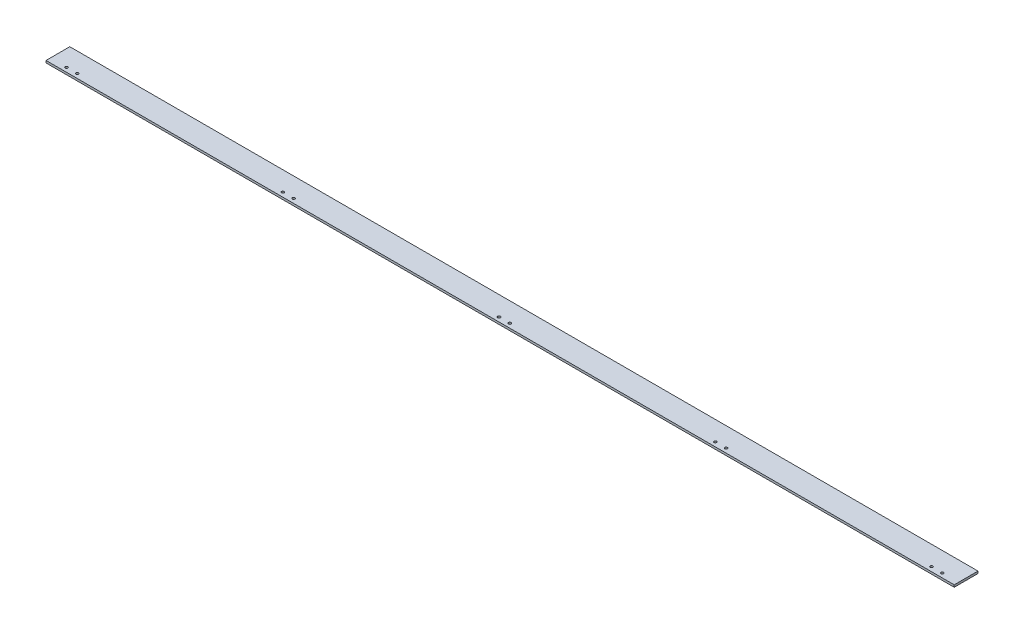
from build123d import *

# Parameters (mm, degrees)
ESQUISSE1_W             = 4200
ESQUISSE1_H             = 110
EXTRUSION1_DEPTH        = 10
ESQUISSE2_R             = 6
ENL_V_MAT_EXTRU_1_DEPTH = 10


with BuildPart() as part:
    # Esquisse1 → Extrusion1 (new body)
    with BuildSketch(Plane(origin=(0, 0, 0), x_dir=(1, 0, 0), z_dir=(0, 1, 0))):
        with Locations((2100, 55)):
            Rectangle(ESQUISSE1_W, ESQUISSE1_H)
    extrude(amount=EXTRUSION1_DEPTH)

    # Esquisse2 → Enl_v. mat.-Extru.1 (cut)
    with BuildSketch(Plane(origin=(0, 10, 0), x_dir=(-1, 0, 0), z_dir=(0, 1, 0))):
        with Locations(Location((-4125, -20, 0), (0, 0, 90))):
            Circle(ESQUISSE2_R)
        with Locations(Location((-4075, -20, 0), (0, 0, 90))):
            Circle(ESQUISSE2_R)
        with Locations(Location((-3125, -20, 0), (0, 0, 90))):
            Circle(ESQUISSE2_R)
        with Locations(Location((-3075, -20, 0), (0, 0, 90))):
            Circle(ESQUISSE2_R)
        with Locations(Location((-2125, -20, 0), (0, 0, 90))):
            Circle(ESQUISSE2_R)
        with Locations(Location((-2075, -20, 0), (0, 0, 90))):
            Circle(ESQUISSE2_R)
        with Locations(Location((-1125, -20, 0), (0, 0, 90))):
            Circle(ESQUISSE2_R)
        with Locations(Location((-1075, -20, 0), (0, 0, 90))):
            Circle(ESQUISSE2_R)
        with Locations(Location((-125, -20, 0), (0, 0, 90))):
            Circle(ESQUISSE2_R)
        with Locations(Location((-75, -20, 0), (0, 0, 90))):
            Circle(ESQUISSE2_R)
    extrude(amount=-ENL_V_MAT_EXTRU_1_DEPTH, mode=Mode.SUBTRACT)


solid = part.part
